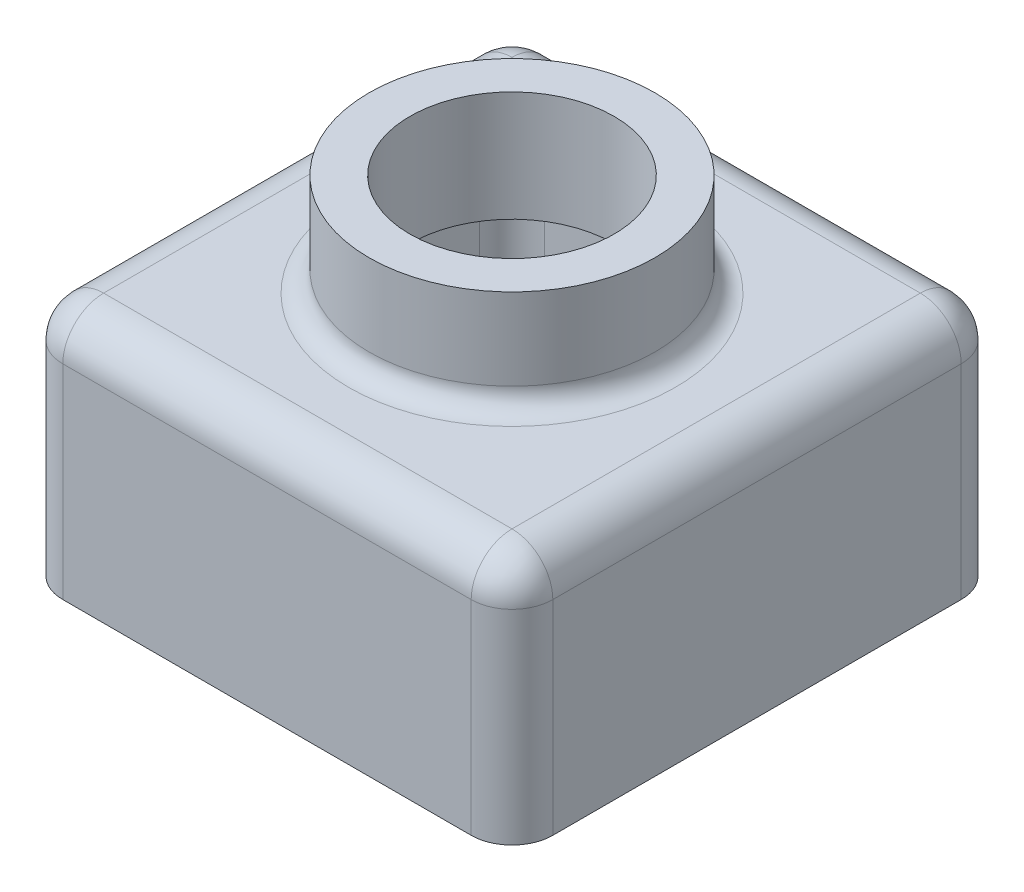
from build123d import *

# Parameters (mm, degrees)
CROQUIS2_W              = 120
CROQUIS2_H              = 120
SALIENTE_EXTRUIR1_DEPTH = 60
REDONDEO1_R             = 10
VACIADO1_T              = -2
CROQUIS3_R              = 35
SALIENTE_EXTRUIR2_DEPTH = 25
CROQUIS4_R              = 25
CORTAR_EXTRUIR1_DEPTH   = 121.104121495
REDONDEO2_R             = 5


with BuildPart() as part:
    # Croquis2 → Saliente-Extruir1 (new body)
    with BuildSketch(Plane(origin=(0, 0, 0), x_dir=(1, 0, 0), z_dir=(0, 1, 0))):
        Rectangle(CROQUIS2_W, CROQUIS2_H)
    extrude(amount=SALIENTE_EXTRUIR1_DEPTH)

    # Redondeo1
    redondeo1_edges = [part.edges().sort_by_distance(p)[0] for p in [
        (-60, 60, 0),
        (0, 60, 60),
        (60, 60, 0),
        (60, 30, 60),
        (-60, 30, 60),
        (-60, 30, -60),
        (60, 30, -60),
        (0, 60, -60),
    ]]
    fillet(redondeo1_edges, radius=REDONDEO1_R)

    # Vaciado1
    vaciado1_openings = [part.faces().sort_by_distance(p)[0] for p in [
        (0, 0, 0),
    ]]
    offset(amount=VACIADO1_T, openings=vaciado1_openings, kind=Kind.INTERSECTION)

    # Croquis3 → Saliente-Extruir2 (add)
    with BuildSketch(Plane(origin=(0, 60, 0), x_dir=(1, 0, 0), z_dir=(0, 1, 0))):
        with Locations(Location((0, 0, 0), (0, 0, 270))):
            Circle(CROQUIS3_R)
    extrude(amount=SALIENTE_EXTRUIR2_DEPTH)

    # Croquis4 → Cortar-Extruir1 (cut, through all)
    with BuildSketch(Plane(origin=(0, 85, 0), x_dir=(1, 0, 0), z_dir=(0, 1, 0))):
        with Locations(Location((0, 0, 0), (0, 0, 270))):
            Circle(CROQUIS4_R)
    extrude(amount=-CORTAR_EXTRUIR1_DEPTH, mode=Mode.SUBTRACT)

    # Redondeo2
    redondeo2_edges = [part.edges().sort_by_distance(p)[0] for p in [
        (0, 60, -35),
    ]]
    fillet(redondeo2_edges, radius=REDONDEO2_R)


solid = part.part
